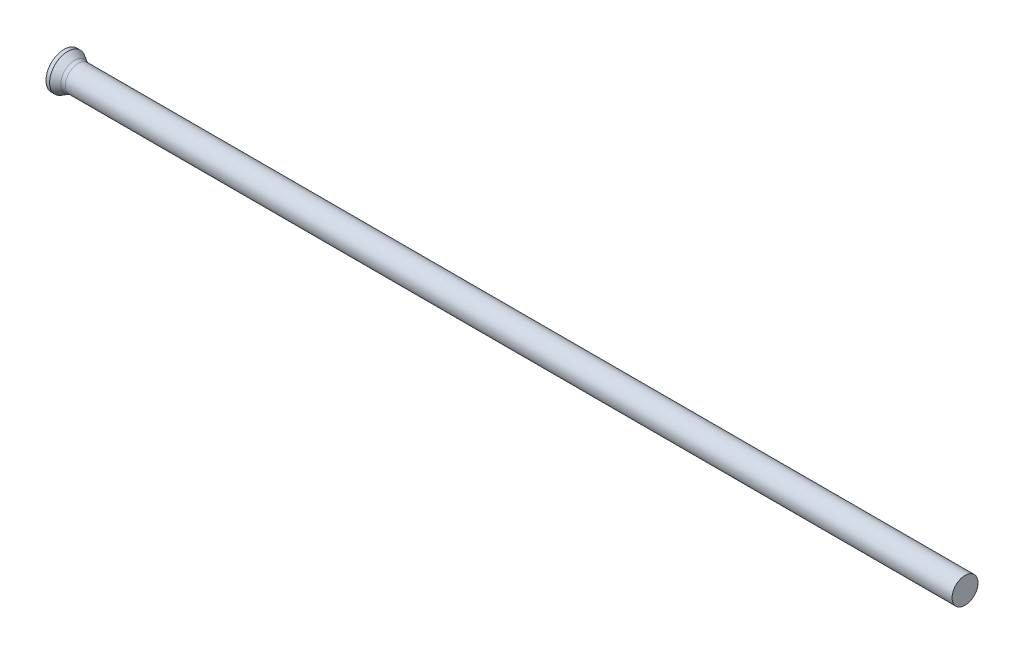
ISO-10303-21;
HEADER;
FILE_DESCRIPTION(('STEP AP214'),'2;1');
FILE_NAME('part.step','',(''),(''),'','','');
FILE_SCHEMA(('AUTOMOTIVE_DESIGN { 1 0 10303 214 1 1 1 1 }'));
ENDSEC;
DATA;
#1=APPLICATION_CONTEXT('core data for automotive mechanical design processes');
#2=APPLICATION_PROTOCOL_DEFINITION('international standard','automotive_design',2000,#1);
#3=PRODUCT_CONTEXT('',#1,'mechanical');
#4=PRODUCT('Part','Part','',(#3));
#5=PRODUCT_RELATED_PRODUCT_CATEGORY('part','',(#4));
#6=PRODUCT_DEFINITION_FORMATION('','',#4);
#7=PRODUCT_DEFINITION_CONTEXT('part definition',#1,'design');
#8=PRODUCT_DEFINITION('design','',#6,#7);
#9=PRODUCT_DEFINITION_SHAPE('','',#8);
#10=(LENGTH_UNIT() NAMED_UNIT(*) SI_UNIT(.MILLI.,.METRE.));
#11=(NAMED_UNIT(*) PLANE_ANGLE_UNIT() SI_UNIT($,.RADIAN.));
#12=(NAMED_UNIT(*) SI_UNIT($,.STERADIAN.) SOLID_ANGLE_UNIT());
#13=UNCERTAINTY_MEASURE_WITH_UNIT(LENGTH_MEASURE(1.E-05),#10,'distance_accuracy_value','');
#14=(GEOMETRIC_REPRESENTATION_CONTEXT(3) GLOBAL_UNCERTAINTY_ASSIGNED_CONTEXT((#13)) GLOBAL_UNIT_ASSIGNED_CONTEXT((#10,
#11,#12)) REPRESENTATION_CONTEXT('',''));
#15=CARTESIAN_POINT('',(0.,0.,0.));
#16=DIRECTION('',(0.,0.,1.));
#17=DIRECTION('',(1.,0.,0.));
#18=AXIS2_PLACEMENT_3D('',#15,#16,#17);
#19=CARTESIAN_POINT('',(0.,0.,0.));
#20=DIRECTION('',(1.,0.,0.));
#21=DIRECTION('',(0.,0.,-1.));
#22=AXIS2_PLACEMENT_3D('',#19,#20,#21);
#23=PLANE('',#22);
#24=CARTESIAN_POINT('',(0.,0.,0.));
#25=DIRECTION('',(-1.,0.,0.));
#26=DIRECTION('',(0.,0.,1.));
#27=AXIS2_PLACEMENT_3D('',#24,#25,#26);
#28=CIRCLE('',#27,2.5);
#29=CARTESIAN_POINT('',(0.,0.,2.5));
#30=VERTEX_POINT('',#29);
#31=EDGE_CURVE('E25',#30,#30,#28,.T.);
#32=ORIENTED_EDGE('',*,*,#31,.T.);
#33=EDGE_LOOP('',(#32));
#34=FACE_BOUND('',#33,.T.);
#35=ADVANCED_FACE('F14',(#34),#23,.F.);
#36=CARTESIAN_POINT('',(0.,0.,0.));
#37=DIRECTION('',(-1.,0.,0.));
#38=DIRECTION('',(0.,0.,1.));
#39=AXIS2_PLACEMENT_3D('',#36,#37,#38);
#40=CYLINDRICAL_SURFACE('',#39,2.5);
#41=ORIENTED_EDGE('',*,*,#31,.F.);
#42=EDGE_LOOP('',(#41));
#43=FACE_BOUND('',#42,.T.);
#44=CARTESIAN_POINT('',(0.497564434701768,0.,0.));
#45=DIRECTION('',(-1.,0.,0.));
#46=DIRECTION('',(0.,0.,1.));
#47=AXIS2_PLACEMENT_3D('',#44,#45,#46);
#48=CIRCLE('',#47,2.5);
#49=CARTESIAN_POINT('',(0.497564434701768,0.,2.5));
#50=VERTEX_POINT('',#49);
#51=EDGE_CURVE('E29',#50,#50,#48,.T.);
#52=ORIENTED_EDGE('',*,*,#51,.T.);
#53=EDGE_LOOP('',(#52));
#54=FACE_BOUND('',#53,.T.);
#55=ADVANCED_FACE('F53',(#43,#54),#40,.T.);
#56=CARTESIAN_POINT('',(1.71,0.,0.));
#57=DIRECTION('',(-1.,0.,0.));
#58=DIRECTION('',(0.,0.,1.));
#59=AXIS2_PLACEMENT_3D('',#56,#57,#58);
#60=CONICAL_SURFACE('',#59,1.8,0.523598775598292);
#61=CARTESIAN_POINT('',(1.47794919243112,0.,0.));
#62=DIRECTION('',(-1.,0.,0.));
#63=DIRECTION('',(0.,0.,1.));
#64=AXIS2_PLACEMENT_3D('',#61,#62,#63);
#65=CIRCLE('',#64,1.93397459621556);
#66=CARTESIAN_POINT('',(1.47794919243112,0.,1.93397459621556));
#67=VERTEX_POINT('',#66);
#68=EDGE_CURVE('E21',#67,#67,#65,.T.);
#69=ORIENTED_EDGE('',*,*,#68,.T.);
#70=EDGE_LOOP('',(#69));
#71=FACE_BOUND('',#70,.T.);
#72=ORIENTED_EDGE('',*,*,#51,.F.);
#73=EDGE_LOOP('',(#72));
#74=FACE_BOUND('',#73,.T.);
#75=ADVANCED_FACE('F50',(#71,#74),#60,.T.);
#76=CARTESIAN_POINT('',(0.,0.,0.));
#77=DIRECTION('',(-1.,0.,0.));
#78=DIRECTION('',(0.,0.,1.));
#79=AXIS2_PLACEMENT_3D('',#76,#77,#78);
#80=CYLINDRICAL_SURFACE('',#79,1.8);
#81=CARTESIAN_POINT('',(1.97794919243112,0.,0.));
#82=DIRECTION('',(-1.,0.,0.));
#83=DIRECTION('',(0.,0.,1.));
#84=AXIS2_PLACEMENT_3D('',#81,#82,#83);
#85=CIRCLE('',#84,1.8);
#86=CARTESIAN_POINT('',(1.97794919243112,0.,1.8));
#87=VERTEX_POINT('',#86);
#88=EDGE_CURVE('E9',#87,#87,#85,.F.);
#89=ORIENTED_EDGE('',*,*,#88,.T.);
#90=EDGE_LOOP('',(#89));
#91=FACE_BOUND('',#90,.T.);
#92=CARTESIAN_POINT('',(125.,0.,0.));
#93=DIRECTION('',(-1.,0.,0.));
#94=DIRECTION('',(0.,0.,1.));
#95=AXIS2_PLACEMENT_3D('',#92,#93,#94);
#96=CIRCLE('',#95,1.8);
#97=CARTESIAN_POINT('',(125.,0.,1.8));
#98=VERTEX_POINT('',#97);
#99=EDGE_CURVE('E34',#98,#98,#96,.T.);
#100=ORIENTED_EDGE('',*,*,#99,.T.);
#101=EDGE_LOOP('',(#100));
#102=FACE_BOUND('',#101,.T.);
#103=ADVANCED_FACE('F38',(#91,#102),#80,.T.);
#104=CARTESIAN_POINT('',(125.,1.8,0.));
#105=DIRECTION('',(-1.,0.,0.));
#106=DIRECTION('',(0.,0.,1.));
#107=AXIS2_PLACEMENT_3D('',#104,#105,#106);
#108=PLANE('',#107);
#109=ORIENTED_EDGE('',*,*,#99,.F.);
#110=EDGE_LOOP('',(#109));
#111=FACE_BOUND('',#110,.T.);
#112=ADVANCED_FACE('F40',(#111),#108,.F.);
#113=CARTESIAN_POINT('',(1.97794919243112,0.,0.));
#114=DIRECTION('',(-1.,0.,0.));
#115=DIRECTION('',(0.,0.,1.));
#116=AXIS2_PLACEMENT_3D('',#113,#114,#115);
#117=TOROIDAL_SURFACE('',#116,2.8,1.);
#118=ORIENTED_EDGE('',*,*,#88,.F.);
#119=EDGE_LOOP('',(#118));
#120=FACE_BOUND('',#119,.T.);
#121=ORIENTED_EDGE('',*,*,#68,.F.);
#122=EDGE_LOOP('',(#121));
#123=FACE_BOUND('',#122,.T.);
#124=ADVANCED_FACE('F16',(#120,#123),#117,.F.);
#125=CLOSED_SHELL('',(#35,#55,#75,#103,#112,#124));
#126=MANIFOLD_SOLID_BREP('B1',#125);
#127=ADVANCED_BREP_SHAPE_REPRESENTATION('',(#18,#126),#14);
#128=SHAPE_DEFINITION_REPRESENTATION(#9,#127);
ENDSEC;
END-ISO-10303-21;
